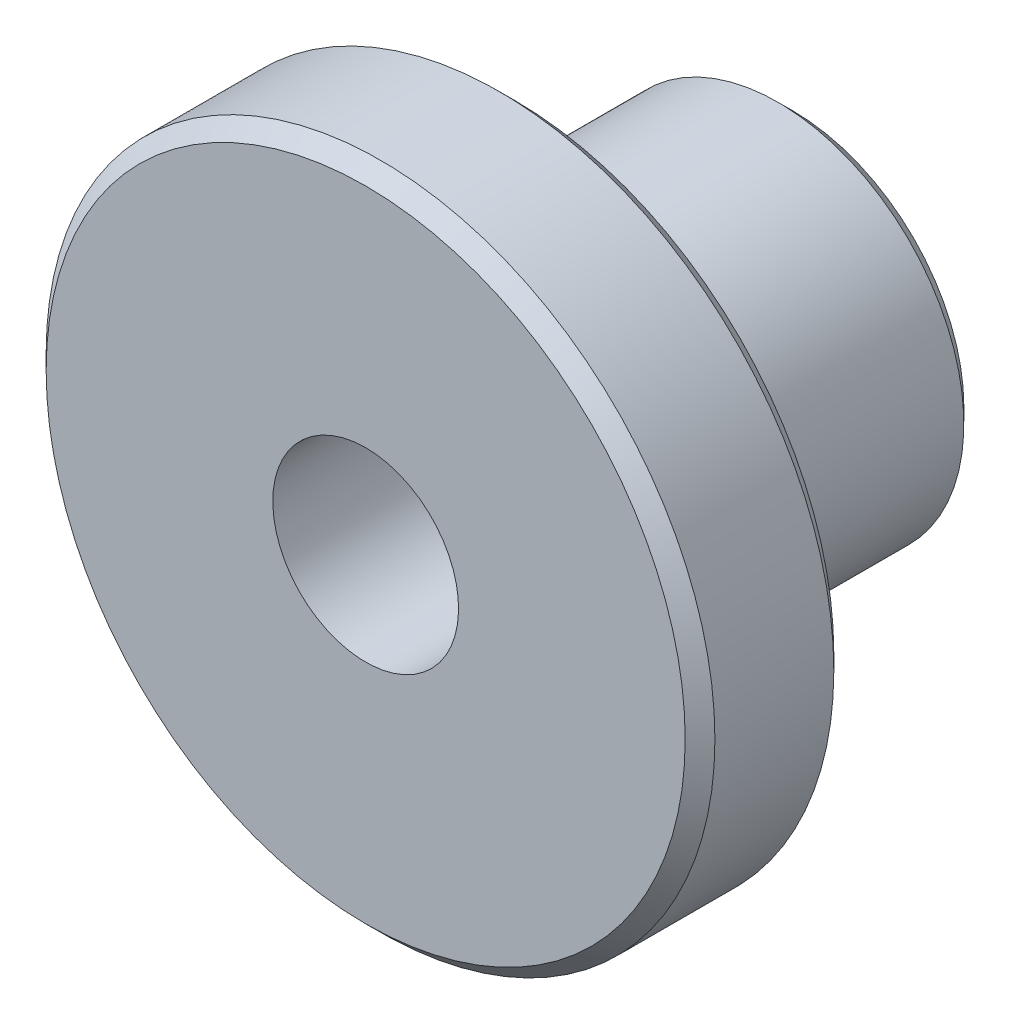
ISO-10303-21;
HEADER;
FILE_DESCRIPTION(('STEP AP214'),'2;1');
FILE_NAME('part.step','',(''),(''),'','','');
FILE_SCHEMA(('AUTOMOTIVE_DESIGN { 1 0 10303 214 1 1 1 1 }'));
ENDSEC;
DATA;
#1=APPLICATION_CONTEXT('core data for automotive mechanical design processes');
#2=APPLICATION_PROTOCOL_DEFINITION('international standard','automotive_design',2000,#1);
#3=PRODUCT_CONTEXT('',#1,'mechanical');
#4=PRODUCT('Part','Part','',(#3));
#5=PRODUCT_RELATED_PRODUCT_CATEGORY('part','',(#4));
#6=PRODUCT_DEFINITION_FORMATION('','',#4);
#7=PRODUCT_DEFINITION_CONTEXT('part definition',#1,'design');
#8=PRODUCT_DEFINITION('design','',#6,#7);
#9=PRODUCT_DEFINITION_SHAPE('','',#8);
#10=(LENGTH_UNIT() NAMED_UNIT(*) SI_UNIT(.MILLI.,.METRE.));
#11=(NAMED_UNIT(*) PLANE_ANGLE_UNIT() SI_UNIT($,.RADIAN.));
#12=(NAMED_UNIT(*) SI_UNIT($,.STERADIAN.) SOLID_ANGLE_UNIT());
#13=UNCERTAINTY_MEASURE_WITH_UNIT(LENGTH_MEASURE(1.E-05),#10,'distance_accuracy_value','');
#14=(GEOMETRIC_REPRESENTATION_CONTEXT(3) GLOBAL_UNCERTAINTY_ASSIGNED_CONTEXT((#13)) GLOBAL_UNIT_ASSIGNED_CONTEXT((#10,
#11,#12)) REPRESENTATION_CONTEXT('',''));
#15=CARTESIAN_POINT('',(0.,0.,0.));
#16=DIRECTION('',(0.,0.,1.));
#17=DIRECTION('',(1.,0.,0.));
#18=AXIS2_PLACEMENT_3D('',#15,#16,#17);
#19=CARTESIAN_POINT('',(0.,0.,0.));
#20=DIRECTION('',(0.,0.,-1.));
#21=DIRECTION('',(0.,1.,0.));
#22=AXIS2_PLACEMENT_3D('',#19,#20,#21);
#23=PLANE('',#22);
#24=CARTESIAN_POINT('',(0.,0.,0.));
#25=DIRECTION('',(0.,0.,-1.));
#26=DIRECTION('',(-1.,0.,0.));
#27=AXIS2_PLACEMENT_3D('',#24,#25,#26);
#28=CIRCLE('',#27,9.2);
#29=CARTESIAN_POINT('',(-9.2,0.,0.));
#30=VERTEX_POINT('',#29);
#31=EDGE_CURVE('E27',#30,#30,#28,.T.);
#32=ORIENTED_EDGE('',*,*,#31,.T.);
#33=EDGE_LOOP('',(#32));
#34=FACE_BOUND('',#33,.T.);
#35=CARTESIAN_POINT('',(0.,0.,0.));
#36=DIRECTION('',(0.,0.,-1.));
#37=DIRECTION('',(0.,1.,0.));
#38=AXIS2_PLACEMENT_3D('',#35,#36,#37);
#39=CIRCLE('',#38,5.);
#40=CARTESIAN_POINT('',(0.,5.,0.));
#41=VERTEX_POINT('',#40);
#42=EDGE_CURVE('E47',#41,#41,#39,.T.);
#43=ORIENTED_EDGE('',*,*,#42,.F.);
#44=EDGE_LOOP('',(#43));
#45=FACE_BOUND('',#44,.T.);
#46=ADVANCED_FACE('F12',(#34,#45),#23,.T.);
#47=CARTESIAN_POINT('',(0.,0.,-10.));
#48=DIRECTION('',(0.,0.,-1.));
#49=DIRECTION('',(0.,1.,0.));
#50=AXIS2_PLACEMENT_3D('',#47,#48,#49);
#51=CYLINDRICAL_SURFACE('',#50,10.);
#52=CARTESIAN_POINT('',(0.,0.,13.));
#53=DIRECTION('',(0.,0.,-1.));
#54=DIRECTION('',(-1.,0.,0.));
#55=AXIS2_PLACEMENT_3D('',#52,#53,#54);
#56=CIRCLE('',#55,10.);
#57=CARTESIAN_POINT('',(-10.,0.,13.));
#58=VERTEX_POINT('',#57);
#59=EDGE_CURVE('E19',#58,#58,#56,.T.);
#60=ORIENTED_EDGE('',*,*,#59,.T.);
#61=EDGE_LOOP('',(#60));
#62=FACE_BOUND('',#61,.T.);
#63=CARTESIAN_POINT('',(0.,0.,0.800000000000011));
#64=DIRECTION('',(0.,0.,-1.));
#65=DIRECTION('',(-1.,0.,0.));
#66=AXIS2_PLACEMENT_3D('',#63,#64,#65);
#67=CIRCLE('',#66,10.);
#68=CARTESIAN_POINT('',(-10.,0.,0.800000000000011));
#69=VERTEX_POINT('',#68);
#70=EDGE_CURVE('E23',#69,#69,#67,.F.);
#71=ORIENTED_EDGE('',*,*,#70,.T.);
#72=EDGE_LOOP('',(#71));
#73=FACE_BOUND('',#72,.T.);
#74=ADVANCED_FACE('F54',(#62,#73),#51,.T.);
#75=CARTESIAN_POINT('',(10.,0.,15.));
#76=DIRECTION('',(0.,0.,-1.));
#77=DIRECTION('',(0.,1.,0.));
#78=AXIS2_PLACEMENT_3D('',#75,#76,#77);
#79=PLANE('',#78);
#80=CARTESIAN_POINT('',(0.,0.,15.));
#81=DIRECTION('',(0.,0.,-1.));
#82=DIRECTION('',(-1.,0.,0.));
#83=AXIS2_PLACEMENT_3D('',#80,#81,#82);
#84=CIRCLE('',#83,12.);
#85=CARTESIAN_POINT('',(-12.,0.,15.));
#86=VERTEX_POINT('',#85);
#87=EDGE_CURVE('E8',#86,#86,#84,.F.);
#88=ORIENTED_EDGE('',*,*,#87,.T.);
#89=EDGE_LOOP('',(#88));
#90=FACE_BOUND('',#89,.T.);
#91=CARTESIAN_POINT('',(0.,0.,15.));
#92=DIRECTION('',(0.,0.,-1.));
#93=DIRECTION('',(-1.,0.,0.));
#94=AXIS2_PLACEMENT_3D('',#91,#92,#93);
#95=CIRCLE('',#94,17.2);
#96=CARTESIAN_POINT('',(-17.2,0.,15.));
#97=VERTEX_POINT('',#96);
#98=EDGE_CURVE('E41',#97,#97,#95,.T.);
#99=ORIENTED_EDGE('',*,*,#98,.T.);
#100=EDGE_LOOP('',(#99));
#101=FACE_BOUND('',#100,.T.);
#102=ADVANCED_FACE('F62',(#90,#101),#79,.T.);
#103=CARTESIAN_POINT('',(0.,0.,-10.));
#104=DIRECTION('',(0.,0.,-1.));
#105=DIRECTION('',(0.,1.,0.));
#106=AXIS2_PLACEMENT_3D('',#103,#104,#105);
#107=CYLINDRICAL_SURFACE('',#106,18.);
#108=CARTESIAN_POINT('',(0.,0.,15.8));
#109=DIRECTION('',(0.,0.,-1.));
#110=DIRECTION('',(-1.,0.,0.));
#111=AXIS2_PLACEMENT_3D('',#108,#109,#110);
#112=CIRCLE('',#111,18.);
#113=CARTESIAN_POINT('',(-18.,0.,15.8));
#114=VERTEX_POINT('',#113);
#115=EDGE_CURVE('E35',#114,#114,#112,.F.);
#116=ORIENTED_EDGE('',*,*,#115,.T.);
#117=EDGE_LOOP('',(#116));
#118=FACE_BOUND('',#117,.T.);
#119=CARTESIAN_POINT('',(0.,0.,22.2));
#120=DIRECTION('',(0.,0.,1.));
#121=DIRECTION('',(1.,0.,0.));
#122=AXIS2_PLACEMENT_3D('',#119,#120,#121);
#123=CIRCLE('',#122,18.);
#124=CARTESIAN_POINT('',(18.,0.,22.2));
#125=VERTEX_POINT('',#124);
#126=EDGE_CURVE('E38',#125,#125,#123,.F.);
#127=ORIENTED_EDGE('',*,*,#126,.T.);
#128=EDGE_LOOP('',(#127));
#129=FACE_BOUND('',#128,.T.);
#130=ADVANCED_FACE('F117',(#118,#129),#107,.T.);
#131=CARTESIAN_POINT('',(18.,0.,23.));
#132=DIRECTION('',(0.,0.,1.));
#133=DIRECTION('',(0.,-1.,0.));
#134=AXIS2_PLACEMENT_3D('',#131,#132,#133);
#135=PLANE('',#134);
#136=CARTESIAN_POINT('',(0.,0.,23.));
#137=DIRECTION('',(0.,0.,1.));
#138=DIRECTION('',(1.,0.,0.));
#139=AXIS2_PLACEMENT_3D('',#136,#137,#138);
#140=CIRCLE('',#139,17.2);
#141=CARTESIAN_POINT('',(17.2,0.,23.));
#142=VERTEX_POINT('',#141);
#143=EDGE_CURVE('E32',#142,#142,#140,.T.);
#144=ORIENTED_EDGE('',*,*,#143,.T.);
#145=EDGE_LOOP('',(#144));
#146=FACE_BOUND('',#145,.T.);
#147=CARTESIAN_POINT('',(0.,0.,23.));
#148=DIRECTION('',(0.,0.,-1.));
#149=DIRECTION('',(0.,1.,0.));
#150=AXIS2_PLACEMENT_3D('',#147,#148,#149);
#151=CIRCLE('',#150,5.);
#152=CARTESIAN_POINT('',(0.,5.,23.));
#153=VERTEX_POINT('',#152);
#154=EDGE_CURVE('E44',#153,#153,#151,.T.);
#155=ORIENTED_EDGE('',*,*,#154,.T.);
#156=EDGE_LOOP('',(#155));
#157=FACE_BOUND('',#156,.T.);
#158=ADVANCED_FACE('F106',(#146,#157),#135,.T.);
#159=CARTESIAN_POINT('',(0.,0.,23.));
#160=DIRECTION('',(0.,0.,-1.));
#161=DIRECTION('',(0.,1.,0.));
#162=AXIS2_PLACEMENT_3D('',#159,#160,#161);
#163=CYLINDRICAL_SURFACE('',#162,5.);
#164=ORIENTED_EDGE('',*,*,#154,.F.);
#165=EDGE_LOOP('',(#164));
#166=FACE_BOUND('',#165,.T.);
#167=ORIENTED_EDGE('',*,*,#42,.T.);
#168=EDGE_LOOP('',(#167));
#169=FACE_BOUND('',#168,.T.);
#170=ADVANCED_FACE('F51',(#166,#169),#163,.F.);
#171=CARTESIAN_POINT('',(0.,0.,15.));
#172=DIRECTION('',(0.,0.,1.));
#173=DIRECTION('',(1.,0.,0.));
#174=AXIS2_PLACEMENT_3D('',#171,#172,#173);
#175=CONICAL_SURFACE('',#174,17.2,0.785398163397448);
#176=ORIENTED_EDGE('',*,*,#115,.F.);
#177=EDGE_LOOP('',(#176));
#178=FACE_BOUND('',#177,.T.);
#179=ORIENTED_EDGE('',*,*,#98,.F.);
#180=EDGE_LOOP('',(#179));
#181=FACE_BOUND('',#180,.T.);
#182=ADVANCED_FACE('F66',(#178,#181),#175,.T.);
#183=CARTESIAN_POINT('',(0.,0.,22.2));
#184=DIRECTION('',(0.,0.,-1.));
#185=DIRECTION('',(-1.,0.,0.));
#186=AXIS2_PLACEMENT_3D('',#183,#184,#185);
#187=CONICAL_SURFACE('',#186,18.,0.785398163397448);
#188=ORIENTED_EDGE('',*,*,#143,.F.);
#189=EDGE_LOOP('',(#188));
#190=FACE_BOUND('',#189,.T.);
#191=ORIENTED_EDGE('',*,*,#126,.F.);
#192=EDGE_LOOP('',(#191));
#193=FACE_BOUND('',#192,.T.);
#194=ADVANCED_FACE('F69',(#190,#193),#187,.T.);
#195=CARTESIAN_POINT('',(0.,0.,0.));
#196=DIRECTION('',(0.,0.,1.));
#197=DIRECTION('',(1.,0.,0.));
#198=AXIS2_PLACEMENT_3D('',#195,#196,#197);
#199=CONICAL_SURFACE('',#198,9.2,0.785398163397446);
#200=ORIENTED_EDGE('',*,*,#70,.F.);
#201=EDGE_LOOP('',(#200));
#202=FACE_BOUND('',#201,.T.);
#203=ORIENTED_EDGE('',*,*,#31,.F.);
#204=EDGE_LOOP('',(#203));
#205=FACE_BOUND('',#204,.T.);
#206=ADVANCED_FACE('F72',(#202,#205),#199,.T.);
#207=CARTESIAN_POINT('',(0.,0.,13.));
#208=DIRECTION('',(0.,0.,-1.));
#209=DIRECTION('',(-1.,0.,0.));
#210=AXIS2_PLACEMENT_3D('',#207,#208,#209);
#211=TOROIDAL_SURFACE('',#210,12.,2.);
#212=ORIENTED_EDGE('',*,*,#87,.F.);
#213=EDGE_LOOP('',(#212));
#214=FACE_BOUND('',#213,.T.);
#215=ORIENTED_EDGE('',*,*,#59,.F.);
#216=EDGE_LOOP('',(#215));
#217=FACE_BOUND('',#216,.T.);
#218=ADVANCED_FACE('F14',(#214,#217),#211,.F.);
#219=CLOSED_SHELL('',(#46,#74,#102,#130,#158,#170,#182,#194,#206,#218));
#220=MANIFOLD_SOLID_BREP('B1',#219);
#221=ADVANCED_BREP_SHAPE_REPRESENTATION('',(#18,#220),#14);
#222=SHAPE_DEFINITION_REPRESENTATION(#9,#221);
ENDSEC;
END-ISO-10303-21;
